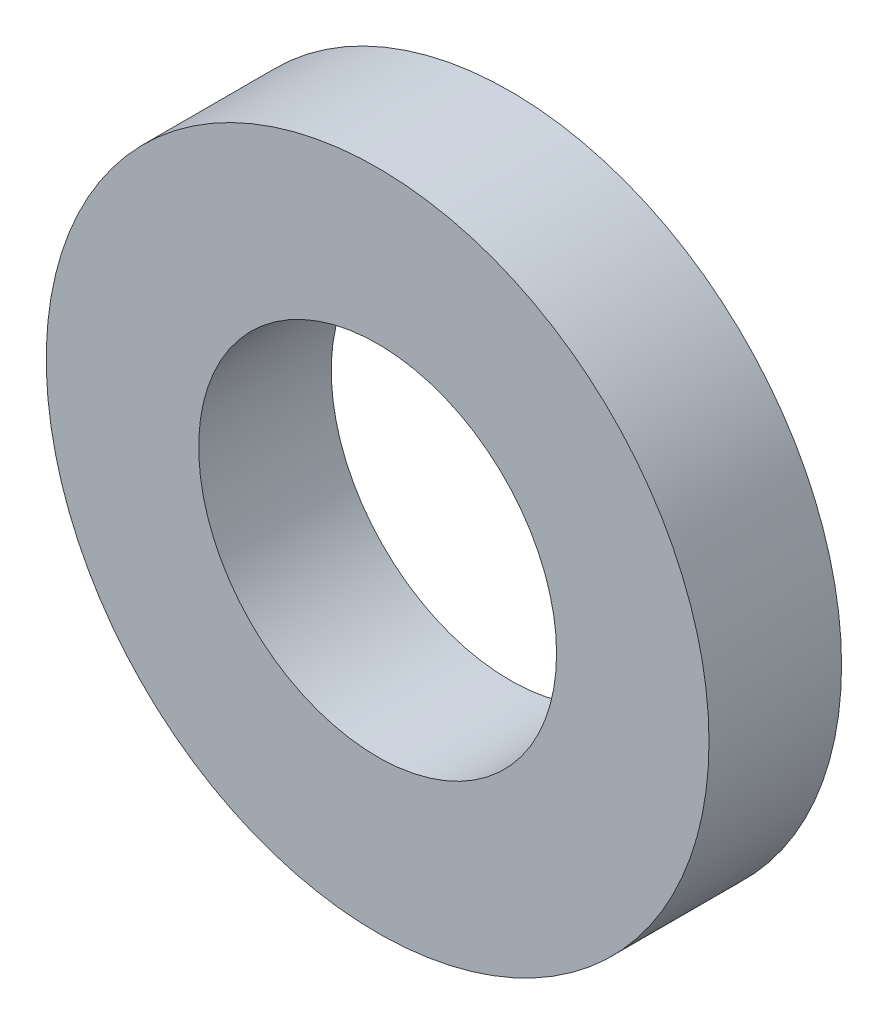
ISO-10303-21;
HEADER;
FILE_DESCRIPTION(('STEP AP214'),'2;1');
FILE_NAME('part.step','',(''),(''),'','','');
FILE_SCHEMA(('AUTOMOTIVE_DESIGN { 1 0 10303 214 1 1 1 1 }'));
ENDSEC;
DATA;
#1=APPLICATION_CONTEXT('core data for automotive mechanical design processes');
#2=APPLICATION_PROTOCOL_DEFINITION('international standard','automotive_design',2000,#1);
#3=PRODUCT_CONTEXT('',#1,'mechanical');
#4=PRODUCT('Part','Part','',(#3));
#5=PRODUCT_RELATED_PRODUCT_CATEGORY('part','',(#4));
#6=PRODUCT_DEFINITION_FORMATION('','',#4);
#7=PRODUCT_DEFINITION_CONTEXT('part definition',#1,'design');
#8=PRODUCT_DEFINITION('design','',#6,#7);
#9=PRODUCT_DEFINITION_SHAPE('','',#8);
#10=(LENGTH_UNIT() NAMED_UNIT(*) SI_UNIT(.MILLI.,.METRE.));
#11=(NAMED_UNIT(*) PLANE_ANGLE_UNIT() SI_UNIT($,.RADIAN.));
#12=(NAMED_UNIT(*) SI_UNIT($,.STERADIAN.) SOLID_ANGLE_UNIT());
#13=UNCERTAINTY_MEASURE_WITH_UNIT(LENGTH_MEASURE(1.E-05),#10,'distance_accuracy_value','');
#14=(GEOMETRIC_REPRESENTATION_CONTEXT(3) GLOBAL_UNCERTAINTY_ASSIGNED_CONTEXT((#13)) GLOBAL_UNIT_ASSIGNED_CONTEXT((#10,
#11,#12)) REPRESENTATION_CONTEXT('',''));
#15=CARTESIAN_POINT('',(0.,0.,0.));
#16=DIRECTION('',(0.,0.,1.));
#17=DIRECTION('',(1.,0.,0.));
#18=AXIS2_PLACEMENT_3D('',#15,#16,#17);
#19=CARTESIAN_POINT('',(17.14,214.32,-27.));
#20=DIRECTION('',(0.,0.,1.));
#21=DIRECTION('',(1.,0.,0.));
#22=AXIS2_PLACEMENT_3D('',#19,#20,#21);
#23=CYLINDRICAL_SURFACE('',#22,7.50000000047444);
#24=CARTESIAN_POINT('',(17.14,214.32,-27.));
#25=DIRECTION('',(0.,0.,1.));
#26=DIRECTION('',(1.,0.,0.));
#27=AXIS2_PLACEMENT_3D('',#24,#25,#26);
#28=CIRCLE('',#27,7.50000000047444);
#29=CARTESIAN_POINT('',(24.6400000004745,214.32,-27.));
#30=VERTEX_POINT('',#29);
#31=EDGE_CURVE('E14',#30,#30,#28,.F.);
#32=CARTESIAN_POINT('',(17.14,214.32,-24.));
#33=DIRECTION('',(0.,0.,1.));
#34=DIRECTION('',(1.,0.,0.));
#35=AXIS2_PLACEMENT_3D('',#32,#33,#34);
#36=CIRCLE('',#35,7.50000000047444);
#37=CARTESIAN_POINT('',(24.6400000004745,214.32,-24.));
#38=VERTEX_POINT('',#37);
#39=EDGE_CURVE('E23',#38,#38,#36,.F.);
#40=CARTESIAN_POINT('',(24.6400000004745,214.32,-27.));
#41=CARTESIAN_POINT('',(24.6400000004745,214.32,-26.96875));
#42=CARTESIAN_POINT('',(24.6400000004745,214.32,-26.9375));
#43=CARTESIAN_POINT('',(24.6400000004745,214.32,-26.875));
#44=CARTESIAN_POINT('',(24.6400000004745,214.32,-26.84375));
#45=CARTESIAN_POINT('',(24.6400000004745,214.32,-26.78125));
#46=CARTESIAN_POINT('',(24.6400000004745,214.32,-26.75));
#47=CARTESIAN_POINT('',(24.6400000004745,214.32,-26.6875));
#48=CARTESIAN_POINT('',(24.6400000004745,214.32,-26.65625));
#49=CARTESIAN_POINT('',(24.6400000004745,214.32,-26.59375));
#50=CARTESIAN_POINT('',(24.6400000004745,214.32,-26.5625));
#51=CARTESIAN_POINT('',(24.6400000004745,214.32,-26.5));
#52=CARTESIAN_POINT('',(24.6400000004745,214.32,-26.46875));
#53=CARTESIAN_POINT('',(24.6400000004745,214.32,-26.40625));
#54=CARTESIAN_POINT('',(24.6400000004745,214.32,-26.375));
#55=CARTESIAN_POINT('',(24.6400000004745,214.32,-26.3125));
#56=CARTESIAN_POINT('',(24.6400000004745,214.32,-26.28125));
#57=CARTESIAN_POINT('',(24.6400000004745,214.32,-26.21875));
#58=CARTESIAN_POINT('',(24.6400000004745,214.32,-26.1875));
#59=CARTESIAN_POINT('',(24.6400000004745,214.32,-26.125));
#60=CARTESIAN_POINT('',(24.6400000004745,214.32,-26.09375));
#61=CARTESIAN_POINT('',(24.6400000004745,214.32,-26.03125));
#62=CARTESIAN_POINT('',(24.6400000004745,214.32,-26.));
#63=CARTESIAN_POINT('',(24.6400000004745,214.32,-25.9375));
#64=CARTESIAN_POINT('',(24.6400000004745,214.32,-25.90625));
#65=CARTESIAN_POINT('',(24.6400000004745,214.32,-25.84375));
#66=CARTESIAN_POINT('',(24.6400000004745,214.32,-25.8125));
#67=CARTESIAN_POINT('',(24.6400000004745,214.32,-25.75));
#68=CARTESIAN_POINT('',(24.6400000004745,214.32,-25.71875));
#69=CARTESIAN_POINT('',(24.6400000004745,214.32,-25.65625));
#70=CARTESIAN_POINT('',(24.6400000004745,214.32,-25.625));
#71=CARTESIAN_POINT('',(24.6400000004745,214.32,-25.5625));
#72=CARTESIAN_POINT('',(24.6400000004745,214.32,-25.53125));
#73=CARTESIAN_POINT('',(24.6400000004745,214.32,-25.46875));
#74=CARTESIAN_POINT('',(24.6400000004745,214.32,-25.4375));
#75=CARTESIAN_POINT('',(24.6400000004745,214.32,-25.375));
#76=CARTESIAN_POINT('',(24.6400000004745,214.32,-25.34375));
#77=CARTESIAN_POINT('',(24.6400000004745,214.32,-25.28125));
#78=CARTESIAN_POINT('',(24.6400000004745,214.32,-25.25));
#79=CARTESIAN_POINT('',(24.6400000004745,214.32,-25.1875));
#80=CARTESIAN_POINT('',(24.6400000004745,214.32,-25.15625));
#81=CARTESIAN_POINT('',(24.6400000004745,214.32,-25.09375));
#82=CARTESIAN_POINT('',(24.6400000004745,214.32,-25.0625));
#83=CARTESIAN_POINT('',(24.6400000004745,214.32,-25.));
#84=CARTESIAN_POINT('',(24.6400000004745,214.32,-24.96875));
#85=CARTESIAN_POINT('',(24.6400000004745,214.32,-24.90625));
#86=CARTESIAN_POINT('',(24.6400000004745,214.32,-24.875));
#87=CARTESIAN_POINT('',(24.6400000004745,214.32,-24.8125));
#88=CARTESIAN_POINT('',(24.6400000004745,214.32,-24.78125));
#89=CARTESIAN_POINT('',(24.6400000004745,214.32,-24.71875));
#90=CARTESIAN_POINT('',(24.6400000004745,214.32,-24.6875));
#91=CARTESIAN_POINT('',(24.6400000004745,214.32,-24.625));
#92=CARTESIAN_POINT('',(24.6400000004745,214.32,-24.59375));
#93=CARTESIAN_POINT('',(24.6400000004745,214.32,-24.53125));
#94=CARTESIAN_POINT('',(24.6400000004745,214.32,-24.5));
#95=CARTESIAN_POINT('',(24.6400000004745,214.32,-24.4375));
#96=CARTESIAN_POINT('',(24.6400000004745,214.32,-24.40625));
#97=CARTESIAN_POINT('',(24.6400000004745,214.32,-24.34375));
#98=CARTESIAN_POINT('',(24.6400000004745,214.32,-24.3125));
#99=CARTESIAN_POINT('',(24.6400000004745,214.32,-24.25));
#100=CARTESIAN_POINT('',(24.6400000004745,214.32,-24.21875));
#101=CARTESIAN_POINT('',(24.6400000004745,214.32,-24.15625));
#102=CARTESIAN_POINT('',(24.6400000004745,214.32,-24.125));
#103=CARTESIAN_POINT('',(24.6400000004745,214.32,-24.0625));
#104=CARTESIAN_POINT('',(24.6400000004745,214.32,-24.03125));
#105=CARTESIAN_POINT('',(24.6400000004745,214.32,-24.));
#106=B_SPLINE_CURVE_WITH_KNOTS('',3,(#40,#41,#42,#43,#44,#45,#46,#47,#48,#49,#50,#51,#52,#53,
#54,#55,#56,#57,#58,#59,#60,#61,#62,#63,#64,#65,#66,#67,#68,#69,#70,#71,#72,#73,#74,#75,#76,#77,
#78,#79,#80,#81,#82,#83,#84,#85,#86,#87,#88,#89,#90,#91,#92,#93,#94,#95,#96,#97,#98,#99,#100,
#101,#102,#103,#104,#105),.UNSPECIFIED.,.F.,.F.,(4,2,2,2,2,2,2,2,2,2,2,2,2,2,2,2,2,2,2,2,2,2,2,
2,2,2,2,2,2,2,2,2,4),(0.,0.0937499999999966,0.187499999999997,0.281249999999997,
0.374999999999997,0.468749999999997,0.562499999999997,0.656249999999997,0.749999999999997,
0.843749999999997,0.937499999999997,1.03125,1.125,1.21875,1.3125,1.40625,1.5,1.59375,1.6875,
1.78125,1.875,1.96875,2.0625,2.15625,2.25,2.34375,2.4375,2.53125,2.625,2.71875,2.8125,2.90625,
3.),.UNSPECIFIED.);
#107=EDGE_CURVE('BSEAM10',#30,#38,#106,.T.);
#108=ORIENTED_EDGE('',*,*,#31,.F.);
#109=ORIENTED_EDGE('',*,*,#39,.T.);
#110=ORIENTED_EDGE('',*,*,#107,.T.);
#111=ORIENTED_EDGE('',*,*,#107,.F.);
#112=EDGE_LOOP('',(#108,#110,#109,#111));
#113=FACE_BOUND('',#112,.T.);
#114=ADVANCED_FACE('F10',(#113),#23,.T.);
#115=CARTESIAN_POINT('',(26.236233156,220.018661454,-27.));
#116=DIRECTION('',(0.,0.,-1.));
#117=DIRECTION('',(-0.223818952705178,-0.974630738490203,0.));
#118=AXIS2_PLACEMENT_3D('',#115,#116,#117);
#119=PLANE('',#118);
#120=CARTESIAN_POINT('',(17.14,214.32,-27.));
#121=DIRECTION('',(0.,0.,1.));
#122=DIRECTION('',(1.,0.,0.));
#123=AXIS2_PLACEMENT_3D('',#120,#121,#122);
#124=CIRCLE('',#123,4.05000000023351);
#125=CARTESIAN_POINT('',(21.1900000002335,214.32,-27.));
#126=VERTEX_POINT('',#125);
#127=EDGE_CURVE('E18',#126,#126,#124,.F.);
#128=ORIENTED_EDGE('',*,*,#127,.F.);
#129=EDGE_LOOP('',(#128));
#130=FACE_BOUND('',#129,.T.);
#131=ORIENTED_EDGE('',*,*,#31,.T.);
#132=EDGE_LOOP('',(#131));
#133=FACE_BOUND('',#132,.T.);
#134=ADVANCED_FACE('F31',(#130,#133),#119,.T.);
#135=CARTESIAN_POINT('',(26.236233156,220.018661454,-24.));
#136=DIRECTION('',(0.,0.,-1.));
#137=DIRECTION('',(-0.223818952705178,-0.974630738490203,0.));
#138=AXIS2_PLACEMENT_3D('',#135,#136,#137);
#139=PLANE('',#138);
#140=CARTESIAN_POINT('',(17.14,214.32,-24.));
#141=DIRECTION('',(0.,0.,1.));
#142=DIRECTION('',(1.,0.,0.));
#143=AXIS2_PLACEMENT_3D('',#140,#141,#142);
#144=CIRCLE('',#143,4.05000000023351);
#145=CARTESIAN_POINT('',(21.1900000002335,214.32,-24.));
#146=VERTEX_POINT('',#145);
#147=EDGE_CURVE('E8',#146,#146,#144,.T.);
#148=ORIENTED_EDGE('',*,*,#147,.F.);
#149=EDGE_LOOP('',(#148));
#150=FACE_BOUND('',#149,.T.);
#151=ORIENTED_EDGE('',*,*,#39,.F.);
#152=EDGE_LOOP('',(#151));
#153=FACE_BOUND('',#152,.T.);
#154=ADVANCED_FACE('F12',(#150,#153),#139,.F.);
#155=CARTESIAN_POINT('',(17.14,214.32,-27.));
#156=DIRECTION('',(0.,0.,1.));
#157=DIRECTION('',(1.,0.,0.));
#158=AXIS2_PLACEMENT_3D('',#155,#156,#157);
#159=CYLINDRICAL_SURFACE('',#158,4.05000000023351);
#160=CARTESIAN_POINT('',(21.1900000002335,214.32,-24.));
#161=CARTESIAN_POINT('',(21.1900000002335,214.32,-24.03125));
#162=CARTESIAN_POINT('',(21.1900000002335,214.32,-24.0625));
#163=CARTESIAN_POINT('',(21.1900000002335,214.32,-24.125));
#164=CARTESIAN_POINT('',(21.1900000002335,214.32,-24.15625));
#165=CARTESIAN_POINT('',(21.1900000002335,214.32,-24.21875));
#166=CARTESIAN_POINT('',(21.1900000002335,214.32,-24.25));
#167=CARTESIAN_POINT('',(21.1900000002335,214.32,-24.3125));
#168=CARTESIAN_POINT('',(21.1900000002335,214.32,-24.34375));
#169=CARTESIAN_POINT('',(21.1900000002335,214.32,-24.40625));
#170=CARTESIAN_POINT('',(21.1900000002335,214.32,-24.4375));
#171=CARTESIAN_POINT('',(21.1900000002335,214.32,-24.5));
#172=CARTESIAN_POINT('',(21.1900000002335,214.32,-24.53125));
#173=CARTESIAN_POINT('',(21.1900000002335,214.32,-24.59375));
#174=CARTESIAN_POINT('',(21.1900000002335,214.32,-24.625));
#175=CARTESIAN_POINT('',(21.1900000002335,214.32,-24.6875));
#176=CARTESIAN_POINT('',(21.1900000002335,214.32,-24.71875));
#177=CARTESIAN_POINT('',(21.1900000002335,214.32,-24.78125));
#178=CARTESIAN_POINT('',(21.1900000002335,214.32,-24.8125));
#179=CARTESIAN_POINT('',(21.1900000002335,214.32,-24.875));
#180=CARTESIAN_POINT('',(21.1900000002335,214.32,-24.90625));
#181=CARTESIAN_POINT('',(21.1900000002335,214.32,-24.96875));
#182=CARTESIAN_POINT('',(21.1900000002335,214.32,-25.));
#183=CARTESIAN_POINT('',(21.1900000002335,214.32,-25.0625));
#184=CARTESIAN_POINT('',(21.1900000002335,214.32,-25.09375));
#185=CARTESIAN_POINT('',(21.1900000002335,214.32,-25.15625));
#186=CARTESIAN_POINT('',(21.1900000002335,214.32,-25.1875));
#187=CARTESIAN_POINT('',(21.1900000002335,214.32,-25.25));
#188=CARTESIAN_POINT('',(21.1900000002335,214.32,-25.28125));
#189=CARTESIAN_POINT('',(21.1900000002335,214.32,-25.34375));
#190=CARTESIAN_POINT('',(21.1900000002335,214.32,-25.375));
#191=CARTESIAN_POINT('',(21.1900000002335,214.32,-25.4375));
#192=CARTESIAN_POINT('',(21.1900000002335,214.32,-25.46875));
#193=CARTESIAN_POINT('',(21.1900000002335,214.32,-25.53125));
#194=CARTESIAN_POINT('',(21.1900000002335,214.32,-25.5625));
#195=CARTESIAN_POINT('',(21.1900000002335,214.32,-25.625));
#196=CARTESIAN_POINT('',(21.1900000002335,214.32,-25.65625));
#197=CARTESIAN_POINT('',(21.1900000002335,214.32,-25.71875));
#198=CARTESIAN_POINT('',(21.1900000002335,214.32,-25.75));
#199=CARTESIAN_POINT('',(21.1900000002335,214.32,-25.8125));
#200=CARTESIAN_POINT('',(21.1900000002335,214.32,-25.84375));
#201=CARTESIAN_POINT('',(21.1900000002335,214.32,-25.90625));
#202=CARTESIAN_POINT('',(21.1900000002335,214.32,-25.9375));
#203=CARTESIAN_POINT('',(21.1900000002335,214.32,-26.));
#204=CARTESIAN_POINT('',(21.1900000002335,214.32,-26.03125));
#205=CARTESIAN_POINT('',(21.1900000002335,214.32,-26.09375));
#206=CARTESIAN_POINT('',(21.1900000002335,214.32,-26.125));
#207=CARTESIAN_POINT('',(21.1900000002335,214.32,-26.1875));
#208=CARTESIAN_POINT('',(21.1900000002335,214.32,-26.21875));
#209=CARTESIAN_POINT('',(21.1900000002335,214.32,-26.28125));
#210=CARTESIAN_POINT('',(21.1900000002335,214.32,-26.3125));
#211=CARTESIAN_POINT('',(21.1900000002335,214.32,-26.375));
#212=CARTESIAN_POINT('',(21.1900000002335,214.32,-26.40625));
#213=CARTESIAN_POINT('',(21.1900000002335,214.32,-26.46875));
#214=CARTESIAN_POINT('',(21.1900000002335,214.32,-26.5));
#215=CARTESIAN_POINT('',(21.1900000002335,214.32,-26.5625));
#216=CARTESIAN_POINT('',(21.1900000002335,214.32,-26.59375));
#217=CARTESIAN_POINT('',(21.1900000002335,214.32,-26.65625));
#218=CARTESIAN_POINT('',(21.1900000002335,214.32,-26.6875));
#219=CARTESIAN_POINT('',(21.1900000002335,214.32,-26.75));
#220=CARTESIAN_POINT('',(21.1900000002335,214.32,-26.78125));
#221=CARTESIAN_POINT('',(21.1900000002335,214.32,-26.84375));
#222=CARTESIAN_POINT('',(21.1900000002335,214.32,-26.875));
#223=CARTESIAN_POINT('',(21.1900000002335,214.32,-26.9375));
#224=CARTESIAN_POINT('',(21.1900000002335,214.32,-26.96875));
#225=CARTESIAN_POINT('',(21.1900000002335,214.32,-27.));
#226=B_SPLINE_CURVE_WITH_KNOTS('',3,(#160,#161,#162,#163,#164,#165,#166,#167,#168,#169,#170,
#171,#172,#173,#174,#175,#176,#177,#178,#179,#180,#181,#182,#183,#184,#185,#186,#187,#188,#189,
#190,#191,#192,#193,#194,#195,#196,#197,#198,#199,#200,#201,#202,#203,#204,#205,#206,#207,#208,
#209,#210,#211,#212,#213,#214,#215,#216,#217,#218,#219,#220,#221,#222,#223,#224,#225),
.UNSPECIFIED.,.F.,.F.,(4,2,2,2,2,2,2,2,2,2,2,2,2,2,2,2,2,2,2,2,2,2,2,2,2,2,2,2,2,2,2,2,4),(0.,
0.0937499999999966,0.187499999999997,0.281249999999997,0.374999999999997,0.468749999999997,
0.562499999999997,0.656249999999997,0.749999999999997,0.843749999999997,0.937499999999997,
1.03125,1.125,1.21875,1.3125,1.40625,1.5,1.59375,1.6875,1.78125,1.875,1.96875,2.0625,2.15625,
2.25,2.34375,2.4375,2.53125,2.625,2.71875,2.8125,2.90625,3.),.UNSPECIFIED.);
#227=EDGE_CURVE('BSEAM40',#146,#126,#226,.T.);
#228=ORIENTED_EDGE('',*,*,#147,.T.);
#229=ORIENTED_EDGE('',*,*,#127,.T.);
#230=ORIENTED_EDGE('',*,*,#227,.T.);
#231=ORIENTED_EDGE('',*,*,#227,.F.);
#232=EDGE_LOOP('',(#228,#230,#229,#231));
#233=FACE_BOUND('',#232,.T.);
#234=ADVANCED_FACE('F40',(#233),#159,.F.);
#235=CLOSED_SHELL('',(#114,#134,#154,#234));
#236=MANIFOLD_SOLID_BREP('B1',#235);
#237=ADVANCED_BREP_SHAPE_REPRESENTATION('',(#18,#236),#14);
#238=SHAPE_DEFINITION_REPRESENTATION(#9,#237);
ENDSEC;
END-ISO-10303-21;
